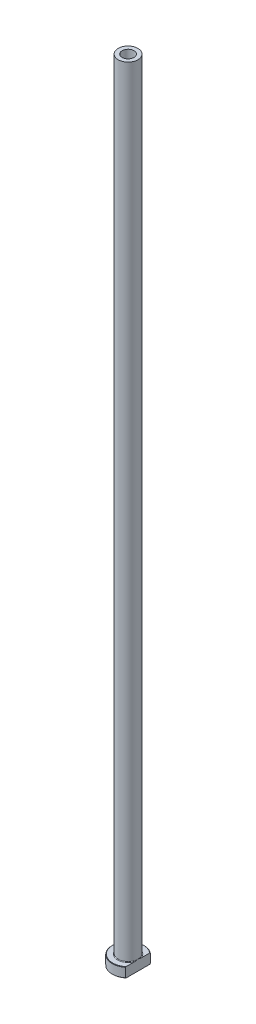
from build123d import *

# Parameters (mm, degrees)
FILLET1_R          = 0.3
CHAMFER1_SIZE      = 0.2
CUT_EXTRUDE1_DEPTH = 401.159968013
CHAMFER2_SIZE      = 0.5


with BuildPart() as part:
    # Sketch1 → Revolve1 (revolve)
    with BuildSketch(Plane.XY, mode=Mode.PRIVATE) as revolve1_sk:
        Polygon((-3, 400), (-5, 400), (-5, 5), (-8, 5), (-8, 0), (-3.25, 0), (-3.25, 343), (-3, 355), align=None)
    revolve(revolve1_sk.sketch.rotate(Axis((0, 92.187680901, 0), (0, -1, 0)), 270), axis=Axis((0, 92.187680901, 0), (0, -1, 0)))

    # Fillet1
    fillet1_edges = [part.edges().sort_by_distance(p)[0] for p in [
        (0, 5, -5),
    ]]
    fillet(fillet1_edges, radius=FILLET1_R)

    # Chamfer1
    chamfer1_edges = [part.edges().sort_by_distance(p)[0] for p in [
        (0, 0, -8),
        (0, 5, -8),
    ]]
    chamfer(chamfer1_edges, length=CHAMFER1_SIZE)

    # Sketch2 → Cut-Extrude1 (cut, through all)
    with BuildSketch(Plane.XZ):
        with BuildLine():
            Line((5, 6.244997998), (5, -6.244997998))
            ThreePointArc((5, -6.244997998), (8, 0), (5, 6.244997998))
        make_face()
    extrude(amount=-CUT_EXTRUDE1_DEPTH, mode=Mode.SUBTRACT)

    # Chamfer2
    chamfer2_edges = [part.edges().sort_by_distance(p)[0] for p in [
        (0, 0, -3.25),
    ]]
    chamfer(chamfer2_edges, length=CHAMFER2_SIZE)


solid = part.part
